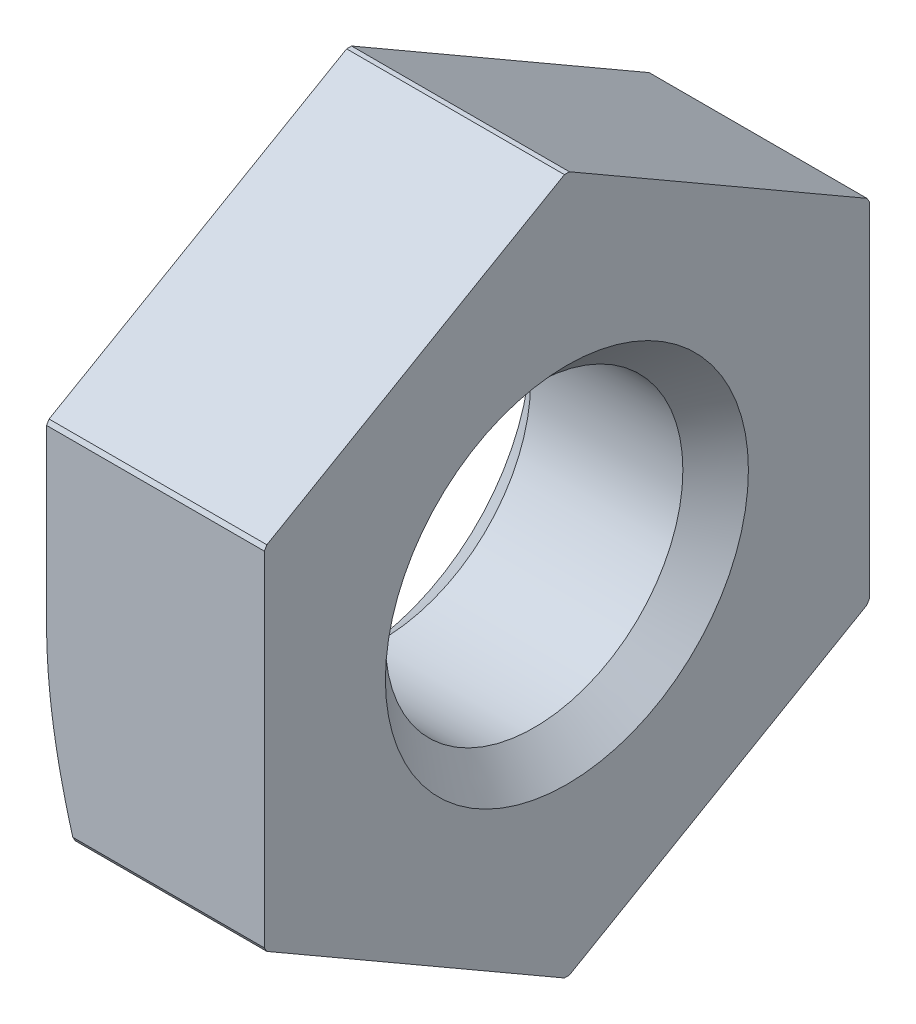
ISO-10303-21;
HEADER;
FILE_DESCRIPTION(('STEP AP214'),'2;1');
FILE_NAME('part.step','',(''),(''),'','','');
FILE_SCHEMA(('AUTOMOTIVE_DESIGN { 1 0 10303 214 1 1 1 1 }'));
ENDSEC;
DATA;
#1=APPLICATION_CONTEXT('core data for automotive mechanical design processes');
#2=APPLICATION_PROTOCOL_DEFINITION('international standard','automotive_design',2000,#1);
#3=PRODUCT_CONTEXT('',#1,'mechanical');
#4=PRODUCT('Part','Part','',(#3));
#5=PRODUCT_RELATED_PRODUCT_CATEGORY('part','',(#4));
#6=PRODUCT_DEFINITION_FORMATION('','',#4);
#7=PRODUCT_DEFINITION_CONTEXT('part definition',#1,'design');
#8=PRODUCT_DEFINITION('design','',#6,#7);
#9=PRODUCT_DEFINITION_SHAPE('','',#8);
#10=(LENGTH_UNIT() NAMED_UNIT(*) SI_UNIT(.MILLI.,.METRE.));
#11=(NAMED_UNIT(*) PLANE_ANGLE_UNIT() SI_UNIT($,.RADIAN.));
#12=(NAMED_UNIT(*) SI_UNIT($,.STERADIAN.) SOLID_ANGLE_UNIT());
#13=UNCERTAINTY_MEASURE_WITH_UNIT(LENGTH_MEASURE(1.E-05),#10,'distance_accuracy_value','');
#14=(GEOMETRIC_REPRESENTATION_CONTEXT(3) GLOBAL_UNCERTAINTY_ASSIGNED_CONTEXT((#13)) GLOBAL_UNIT_ASSIGNED_CONTEXT((#10,
#11,#12)) REPRESENTATION_CONTEXT('',''));
#15=CARTESIAN_POINT('',(0.,0.,0.));
#16=DIRECTION('',(0.,0.,1.));
#17=DIRECTION('',(1.,0.,0.));
#18=AXIS2_PLACEMENT_3D('',#15,#16,#17);
#19=CARTESIAN_POINT('',(-1.1,0.,0.));
#20=DIRECTION('',(1.,0.,0.));
#21=DIRECTION('',(0.,0.,-1.));
#22=AXIS2_PLACEMENT_3D('',#19,#20,#21);
#23=CYLINDRICAL_SURFACE('',#22,5.75);
#24=CARTESIAN_POINT('',(2.5,0.,0.));
#25=DIRECTION('',(1.,0.,0.));
#26=DIRECTION('',(0.,0.,-1.));
#27=AXIS2_PLACEMENT_3D('',#24,#25,#26);
#28=CIRCLE('',#27,5.75);
#29=CARTESIAN_POINT('',(2.5,2.91039993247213,4.95903944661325));
#30=VERTEX_POINT('',#29);
#31=CARTESIAN_POINT('',(2.5,2.83945417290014,5.));
#32=VERTEX_POINT('',#31);
#33=EDGE_CURVE('E181',#30,#32,#28,.T.);
#34=ORIENTED_EDGE('',*,*,#33,.F.);
#35=DIRECTION('',(1.,0.,0.));
#36=VECTOR('',#35,1.);
#37=CARTESIAN_POINT('',(-1.1,2.91039993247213,4.95903944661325));
#38=LINE('',#37,#36);
#39=CARTESIAN_POINT('',(-1.1,2.91039993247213,4.95903944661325));
#40=VERTEX_POINT('',#39);
#41=EDGE_CURVE('E151',#40,#30,#38,.T.);
#42=ORIENTED_EDGE('',*,*,#41,.F.);
#43=CARTESIAN_POINT('',(-1.1,0.,0.));
#44=DIRECTION('',(1.,0.,0.));
#45=DIRECTION('',(0.,0.,-1.));
#46=AXIS2_PLACEMENT_3D('',#43,#44,#45);
#47=CIRCLE('',#46,5.75);
#48=CARTESIAN_POINT('',(-1.1,2.83945417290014,5.));
#49=VERTEX_POINT('',#48);
#50=EDGE_CURVE('E147',#40,#49,#47,.T.);
#51=ORIENTED_EDGE('',*,*,#50,.T.);
#52=DIRECTION('',(1.,0.,0.));
#53=VECTOR('',#52,1.);
#54=CARTESIAN_POINT('',(-1.1,2.83945417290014,5.));
#55=LINE('',#54,#53);
#56=EDGE_CURVE('E131',#49,#32,#55,.T.);
#57=ORIENTED_EDGE('',*,*,#56,.T.);
#58=EDGE_LOOP('',(#34,#42,#51,#57));
#59=FACE_BOUND('',#58,.T.);
#60=ADVANCED_FACE('F32',(#59),#23,.T.);
#61=CARTESIAN_POINT('',(-1.1,5.74985410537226,0.040960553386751));
#62=DIRECTION('',(0.,0.866025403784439,0.5));
#63=DIRECTION('',(0.,-0.5,0.866025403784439));
#64=AXIS2_PLACEMENT_3D('',#61,#62,#63);
#65=PLANE('',#64);
#66=DIRECTION('',(0.,-0.5,0.866025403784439));
#67=VECTOR('',#66,1.);
#68=CARTESIAN_POINT('',(2.5,5.74985410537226,0.040960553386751));
#69=LINE('',#68,#67);
#70=CARTESIAN_POINT('',(2.5,5.74985410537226,0.0409605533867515));
#71=VERTEX_POINT('',#70);
#72=EDGE_CURVE('E152',#71,#30,#69,.T.);
#73=ORIENTED_EDGE('',*,*,#72,.F.);
#74=DIRECTION('',(1.,0.,0.));
#75=VECTOR('',#74,1.);
#76=CARTESIAN_POINT('',(-1.1,5.74985410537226,0.0409605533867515));
#77=LINE('',#76,#75);
#78=CARTESIAN_POINT('',(-1.1,5.74985410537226,0.0409605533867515));
#79=VERTEX_POINT('',#78);
#80=EDGE_CURVE('E212',#79,#71,#77,.T.);
#81=ORIENTED_EDGE('',*,*,#80,.F.);
#82=DIRECTION('',(0.,-0.5,0.866025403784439));
#83=VECTOR('',#82,1.);
#84=CARTESIAN_POINT('',(-1.1,5.74985410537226,0.040960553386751));
#85=LINE('',#84,#83);
#86=EDGE_CURVE('E142',#79,#40,#85,.T.);
#87=ORIENTED_EDGE('',*,*,#86,.T.);
#88=ORIENTED_EDGE('',*,*,#41,.T.);
#89=EDGE_LOOP('',(#73,#81,#87,#88));
#90=FACE_BOUND('',#89,.T.);
#91=ADVANCED_FACE('F265',(#90),#65,.T.);
#92=CARTESIAN_POINT('',(-1.1,0.,0.));
#93=DIRECTION('',(1.,0.,0.));
#94=DIRECTION('',(0.,0.,-1.));
#95=AXIS2_PLACEMENT_3D('',#92,#93,#94);
#96=CYLINDRICAL_SURFACE('',#95,5.75);
#97=CARTESIAN_POINT('',(2.5,0.,0.));
#98=DIRECTION('',(1.,0.,0.));
#99=DIRECTION('',(0.,0.,-1.));
#100=AXIS2_PLACEMENT_3D('',#97,#98,#99);
#101=CIRCLE('',#100,5.75);
#102=CARTESIAN_POINT('',(2.5,5.74985410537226,-0.0409605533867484));
#103=VERTEX_POINT('',#102);
#104=EDGE_CURVE('E155',#103,#71,#101,.T.);
#105=ORIENTED_EDGE('',*,*,#104,.F.);
#106=DIRECTION('',(1.,0.,0.));
#107=VECTOR('',#106,1.);
#108=CARTESIAN_POINT('',(-1.1,5.74985410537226,-0.0409605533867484));
#109=LINE('',#108,#107);
#110=CARTESIAN_POINT('',(-1.1,5.74985410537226,-0.0409605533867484));
#111=VERTEX_POINT('',#110);
#112=EDGE_CURVE('E214',#111,#103,#109,.T.);
#113=ORIENTED_EDGE('',*,*,#112,.F.);
#114=CARTESIAN_POINT('',(-1.1,0.,0.));
#115=DIRECTION('',(1.,0.,0.));
#116=DIRECTION('',(0.,0.,-1.));
#117=AXIS2_PLACEMENT_3D('',#114,#115,#116);
#118=CIRCLE('',#117,5.75);
#119=EDGE_CURVE('E177',#111,#79,#118,.T.);
#120=ORIENTED_EDGE('',*,*,#119,.T.);
#121=ORIENTED_EDGE('',*,*,#80,.T.);
#122=EDGE_LOOP('',(#105,#113,#120,#121));
#123=FACE_BOUND('',#122,.T.);
#124=ADVANCED_FACE('F296',(#123),#96,.T.);
#125=CARTESIAN_POINT('',(-1.1,2.91039993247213,-4.95903944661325));
#126=DIRECTION('',(0.,0.866025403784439,-0.5));
#127=DIRECTION('',(0.,0.5,0.866025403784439));
#128=AXIS2_PLACEMENT_3D('',#125,#126,#127);
#129=PLANE('',#128);
#130=DIRECTION('',(0.,0.5,0.866025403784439));
#131=VECTOR('',#130,1.);
#132=CARTESIAN_POINT('',(2.5,2.91039993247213,-4.95903944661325));
#133=LINE('',#132,#131);
#134=CARTESIAN_POINT('',(2.5,2.91039993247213,-4.95903944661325));
#135=VERTEX_POINT('',#134);
#136=EDGE_CURVE('E205',#135,#103,#133,.T.);
#137=ORIENTED_EDGE('',*,*,#136,.F.);
#138=DIRECTION('',(1.,0.,0.));
#139=VECTOR('',#138,1.);
#140=CARTESIAN_POINT('',(-1.1,2.91039993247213,-4.95903944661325));
#141=LINE('',#140,#139);
#142=CARTESIAN_POINT('',(-1.1,2.91039993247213,-4.95903944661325));
#143=VERTEX_POINT('',#142);
#144=EDGE_CURVE('E216',#143,#135,#141,.T.);
#145=ORIENTED_EDGE('',*,*,#144,.F.);
#146=DIRECTION('',(0.,0.5,0.866025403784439));
#147=VECTOR('',#146,1.);
#148=CARTESIAN_POINT('',(-1.1,2.91039993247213,-4.95903944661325));
#149=LINE('',#148,#147);
#150=EDGE_CURVE('E174',#143,#111,#149,.T.);
#151=ORIENTED_EDGE('',*,*,#150,.T.);
#152=ORIENTED_EDGE('',*,*,#112,.T.);
#153=EDGE_LOOP('',(#137,#145,#151,#152));
#154=FACE_BOUND('',#153,.T.);
#155=ADVANCED_FACE('F300',(#154),#129,.T.);
#156=CARTESIAN_POINT('',(-1.1,0.,0.));
#157=DIRECTION('',(1.,0.,0.));
#158=DIRECTION('',(0.,0.,-1.));
#159=AXIS2_PLACEMENT_3D('',#156,#157,#158);
#160=CYLINDRICAL_SURFACE('',#159,5.75);
#161=CARTESIAN_POINT('',(2.5,0.,0.));
#162=DIRECTION('',(1.,0.,0.));
#163=DIRECTION('',(0.,0.,-1.));
#164=AXIS2_PLACEMENT_3D('',#161,#162,#163);
#165=CIRCLE('',#164,5.75);
#166=CARTESIAN_POINT('',(2.5,2.83945417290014,-5.));
#167=VERTEX_POINT('',#166);
#168=EDGE_CURVE('E202',#167,#135,#165,.T.);
#169=ORIENTED_EDGE('',*,*,#168,.F.);
#170=DIRECTION('',(1.,0.,0.));
#171=VECTOR('',#170,1.);
#172=CARTESIAN_POINT('',(-1.1,2.83945417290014,-5.));
#173=LINE('',#172,#171);
#174=CARTESIAN_POINT('',(-1.1,2.83945417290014,-5.));
#175=VERTEX_POINT('',#174);
#176=EDGE_CURVE('E218',#175,#167,#173,.T.);
#177=ORIENTED_EDGE('',*,*,#176,.F.);
#178=CARTESIAN_POINT('',(-1.1,0.,0.));
#179=DIRECTION('',(1.,0.,0.));
#180=DIRECTION('',(0.,0.,-1.));
#181=AXIS2_PLACEMENT_3D('',#178,#179,#180);
#182=CIRCLE('',#181,5.75);
#183=EDGE_CURVE('E171',#175,#143,#182,.T.);
#184=ORIENTED_EDGE('',*,*,#183,.T.);
#185=ORIENTED_EDGE('',*,*,#144,.T.);
#186=EDGE_LOOP('',(#169,#177,#184,#185));
#187=FACE_BOUND('',#186,.T.);
#188=ADVANCED_FACE('F304',(#187),#160,.T.);
#189=CARTESIAN_POINT('',(-1.1,-2.83945417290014,-5.));
#190=DIRECTION('',(0.,0.,-1.));
#191=DIRECTION('',(-1.,0.,0.));
#192=AXIS2_PLACEMENT_3D('',#189,#190,#191);
#193=PLANE('',#192);
#194=DIRECTION('',(0.,1.,0.));
#195=VECTOR('',#194,1.);
#196=CARTESIAN_POINT('',(2.5,-2.83945417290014,-5.));
#197=LINE('',#196,#195);
#198=CARTESIAN_POINT('',(2.5,-2.83945417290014,-5.));
#199=VERTEX_POINT('',#198);
#200=EDGE_CURVE('E199',#199,#167,#197,.T.);
#201=ORIENTED_EDGE('',*,*,#200,.F.);
#202=DIRECTION('',(1.,0.,0.));
#203=VECTOR('',#202,1.);
#204=CARTESIAN_POINT('',(-1.1,-2.83945417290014,-5.));
#205=LINE('',#204,#203);
#206=CARTESIAN_POINT('',(-1.1,-2.83945417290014,-5.));
#207=VERTEX_POINT('',#206);
#208=EDGE_CURVE('E220',#207,#199,#205,.T.);
#209=ORIENTED_EDGE('',*,*,#208,.F.);
#210=DIRECTION('',(0.,1.,0.));
#211=VECTOR('',#210,1.);
#212=CARTESIAN_POINT('',(-1.1,-2.83945417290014,-5.));
#213=LINE('',#212,#211);
#214=EDGE_CURVE('E168',#207,#175,#213,.T.);
#215=ORIENTED_EDGE('',*,*,#214,.T.);
#216=ORIENTED_EDGE('',*,*,#176,.T.);
#217=EDGE_LOOP('',(#201,#209,#215,#216));
#218=FACE_BOUND('',#217,.T.);
#219=ADVANCED_FACE('F308',(#218),#193,.T.);
#220=CARTESIAN_POINT('',(-1.1,0.,0.));
#221=DIRECTION('',(1.,0.,0.));
#222=DIRECTION('',(0.,0.,-1.));
#223=AXIS2_PLACEMENT_3D('',#220,#221,#222);
#224=CYLINDRICAL_SURFACE('',#223,5.75);
#225=CARTESIAN_POINT('',(2.5,0.,0.));
#226=DIRECTION('',(1.,0.,0.));
#227=DIRECTION('',(0.,0.,-1.));
#228=AXIS2_PLACEMENT_3D('',#225,#226,#227);
#229=CIRCLE('',#228,5.75);
#230=CARTESIAN_POINT('',(2.5,-2.91039993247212,-4.95903944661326));
#231=VERTEX_POINT('',#230);
#232=EDGE_CURVE('E196',#231,#199,#229,.T.);
#233=ORIENTED_EDGE('',*,*,#232,.F.);
#234=DIRECTION('',(1.,0.,0.));
#235=VECTOR('',#234,1.);
#236=CARTESIAN_POINT('',(-1.1,-2.91039993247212,-4.95903944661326));
#237=LINE('',#236,#235);
#238=CARTESIAN_POINT('',(-1.1,-2.91039993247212,-4.95903944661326));
#239=VERTEX_POINT('',#238);
#240=EDGE_CURVE('E222',#239,#231,#237,.T.);
#241=ORIENTED_EDGE('',*,*,#240,.F.);
#242=CARTESIAN_POINT('',(-1.1,0.,0.));
#243=DIRECTION('',(1.,0.,0.));
#244=DIRECTION('',(0.,0.,-1.));
#245=AXIS2_PLACEMENT_3D('',#242,#243,#244);
#246=CIRCLE('',#245,5.75);
#247=EDGE_CURVE('E165',#239,#207,#246,.T.);
#248=ORIENTED_EDGE('',*,*,#247,.T.);
#249=ORIENTED_EDGE('',*,*,#208,.T.);
#250=EDGE_LOOP('',(#233,#241,#248,#249));
#251=FACE_BOUND('',#250,.T.);
#252=ADVANCED_FACE('F312',(#251),#224,.T.);
#253=CARTESIAN_POINT('',(-1.1,-5.74985410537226,-0.0409605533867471));
#254=DIRECTION('',(0.,-0.866025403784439,-0.5));
#255=DIRECTION('',(0.,0.5,-0.866025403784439));
#256=AXIS2_PLACEMENT_3D('',#253,#254,#255);
#257=PLANE('',#256);
#258=DIRECTION('',(0.,0.5,-0.866025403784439));
#259=VECTOR('',#258,1.);
#260=CARTESIAN_POINT('',(2.5,-5.74985410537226,-0.0409605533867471));
#261=LINE('',#260,#259);
#262=CARTESIAN_POINT('',(2.5,-5.74985410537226,-0.0409605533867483));
#263=VERTEX_POINT('',#262);
#264=EDGE_CURVE('E193',#263,#231,#261,.T.);
#265=ORIENTED_EDGE('',*,*,#264,.F.);
#266=DIRECTION('',(1.,0.,0.));
#267=VECTOR('',#266,1.);
#268=CARTESIAN_POINT('',(-1.1,-5.74985410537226,-0.0409605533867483));
#269=LINE('',#268,#267);
#270=CARTESIAN_POINT('',(-1.1,-5.74985410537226,-0.0409605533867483));
#271=VERTEX_POINT('',#270);
#272=EDGE_CURVE('E224',#271,#263,#269,.T.);
#273=ORIENTED_EDGE('',*,*,#272,.F.);
#274=DIRECTION('',(0.,0.5,-0.866025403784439));
#275=VECTOR('',#274,1.);
#276=CARTESIAN_POINT('',(-1.1,-5.74985410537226,-0.0409605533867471));
#277=LINE('',#276,#275);
#278=EDGE_CURVE('E162',#271,#239,#277,.T.);
#279=ORIENTED_EDGE('',*,*,#278,.T.);
#280=ORIENTED_EDGE('',*,*,#240,.T.);
#281=EDGE_LOOP('',(#265,#273,#279,#280));
#282=FACE_BOUND('',#281,.T.);
#283=ADVANCED_FACE('F315',(#282),#257,.T.);
#284=CARTESIAN_POINT('',(-1.1,0.,0.));
#285=DIRECTION('',(1.,0.,0.));
#286=DIRECTION('',(0.,0.,-1.));
#287=AXIS2_PLACEMENT_3D('',#284,#285,#286);
#288=CYLINDRICAL_SURFACE('',#287,5.75);
#289=CARTESIAN_POINT('',(2.5,0.,0.));
#290=DIRECTION('',(1.,0.,0.));
#291=DIRECTION('',(0.,0.,-1.));
#292=AXIS2_PLACEMENT_3D('',#289,#290,#291);
#293=CIRCLE('',#292,5.75);
#294=CARTESIAN_POINT('',(2.5,-5.74985410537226,0.0409605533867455));
#295=VERTEX_POINT('',#294);
#296=EDGE_CURVE('E190',#295,#263,#293,.T.);
#297=ORIENTED_EDGE('',*,*,#296,.F.);
#298=DIRECTION('',(1.,0.,0.));
#299=VECTOR('',#298,1.);
#300=CARTESIAN_POINT('',(-1.1,-5.74985410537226,0.0409605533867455));
#301=LINE('',#300,#299);
#302=CARTESIAN_POINT('',(-1.1,-5.74985410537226,0.0409605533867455));
#303=VERTEX_POINT('',#302);
#304=EDGE_CURVE('E226',#303,#295,#301,.T.);
#305=ORIENTED_EDGE('',*,*,#304,.F.);
#306=CARTESIAN_POINT('',(-1.1,0.,0.));
#307=DIRECTION('',(1.,0.,0.));
#308=DIRECTION('',(0.,0.,-1.));
#309=AXIS2_PLACEMENT_3D('',#306,#307,#308);
#310=CIRCLE('',#309,5.75);
#311=EDGE_CURVE('E159',#303,#271,#310,.T.);
#312=ORIENTED_EDGE('',*,*,#311,.T.);
#313=ORIENTED_EDGE('',*,*,#272,.T.);
#314=EDGE_LOOP('',(#297,#305,#312,#313));
#315=FACE_BOUND('',#314,.T.);
#316=ADVANCED_FACE('F256',(#315),#288,.T.);
#317=CARTESIAN_POINT('',(-1.1,-2.91039993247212,4.95903944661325));
#318=DIRECTION('',(0.,-0.866025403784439,0.5));
#319=DIRECTION('',(0.,-0.5,-0.866025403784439));
#320=AXIS2_PLACEMENT_3D('',#317,#318,#319);
#321=PLANE('',#320);
#322=DIRECTION('',(1.,0.,0.));
#323=VECTOR('',#322,1.);
#324=CARTESIAN_POINT('',(-1.1,-2.91039993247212,4.95903944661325));
#325=LINE('',#324,#323);
#326=CARTESIAN_POINT('',(-0.666987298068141,-2.91039993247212,4.95903944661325));
#327=VERTEX_POINT('',#326);
#328=CARTESIAN_POINT('',(2.5,-2.91039993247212,4.95903944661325));
#329=VERTEX_POINT('',#328);
#330=EDGE_CURVE('E228',#327,#329,#325,.T.);
#331=ORIENTED_EDGE('',*,*,#330,.F.);
#332=CARTESIAN_POINT('',(-0.666987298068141,-2.91039993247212,4.95903944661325));
#333=CARTESIAN_POINT('',(-0.732939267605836,-3.0260257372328,4.75876967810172));
#334=CARTESIAN_POINT('',(-0.793293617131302,-3.14256291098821,4.55692137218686));
#335=CARTESIAN_POINT('',(-0.899648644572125,-3.3766446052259,4.15147998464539));
#336=CARTESIAN_POINT('',(-0.945718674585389,-3.49418131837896,3.94790042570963));
#337=CARTESIAN_POINT('',(-1.0022437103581,-3.6715634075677,3.64066563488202));
#338=CARTESIAN_POINT('',(-1.01899522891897,-3.73090758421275,3.53787850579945));
#339=CARTESIAN_POINT('',(-1.04798386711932,-3.84987170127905,3.33182661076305));
#340=CARTESIAN_POINT('',(-1.06022109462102,-3.90949163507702,3.22856185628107));
#341=CARTESIAN_POINT('',(-1.07997267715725,-4.02922256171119,3.02118180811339));
#342=CARTESIAN_POINT('',(-1.08746357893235,-4.08933452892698,2.91706482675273));
#343=CARTESIAN_POINT('',(-1.09748725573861,-4.20967241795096,2.7086334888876));
#344=CARTESIAN_POINT('',(-1.10001911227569,-4.26989835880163,2.60431909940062));
#345=CARTESIAN_POINT('',(-1.09999999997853,-4.33012701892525,2.4999999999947));
#346=B_SPLINE_CURVE_WITH_KNOTS('',3,(#332,#333,#334,#335,#336,#337,#338,#339,#340,#341,#342,
#343,#344,#345),.UNSPECIFIED.,.F.,.F.,(4,2,2,2,2,2,4),(0.,0.721695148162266,1.43982943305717,
1.79934484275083,2.15885166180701,2.52012135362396,2.88145795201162),.UNSPECIFIED.);
#347=CARTESIAN_POINT('',(-1.1,-4.33012701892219,2.5));
#348=VERTEX_POINT('',#347);
#349=EDGE_CURVE('E60',#327,#348,#346,.T.);
#350=ORIENTED_EDGE('',*,*,#349,.T.);
#351=DIRECTION('',(0.,-0.5,-0.866025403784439));
#352=VECTOR('',#351,1.);
#353=CARTESIAN_POINT('',(-1.1,-2.91039993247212,4.95903944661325));
#354=LINE('',#353,#352);
#355=EDGE_CURVE('E149',#348,#303,#354,.T.);
#356=ORIENTED_EDGE('',*,*,#355,.T.);
#357=ORIENTED_EDGE('',*,*,#304,.T.);
#358=DIRECTION('',(0.,-0.5,-0.866025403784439));
#359=VECTOR('',#358,1.);
#360=CARTESIAN_POINT('',(2.5,-2.91039993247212,4.95903944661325));
#361=LINE('',#360,#359);
#362=EDGE_CURVE('E187',#329,#295,#361,.T.);
#363=ORIENTED_EDGE('',*,*,#362,.F.);
#364=EDGE_LOOP('',(#331,#350,#356,#357,#363));
#365=FACE_BOUND('',#364,.T.);
#366=ADVANCED_FACE('F250',(#365),#321,.T.);
#367=CARTESIAN_POINT('',(-1.1,0.,0.));
#368=DIRECTION('',(1.,0.,0.));
#369=DIRECTION('',(0.,0.,-1.));
#370=AXIS2_PLACEMENT_3D('',#367,#368,#369);
#371=CYLINDRICAL_SURFACE('',#370,5.75);
#372=DIRECTION('',(1.,0.,0.));
#373=VECTOR('',#372,1.);
#374=CARTESIAN_POINT('',(-1.1,-2.83945417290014,5.));
#375=LINE('',#374,#373);
#376=CARTESIAN_POINT('',(-0.666987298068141,-2.83945417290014,5.));
#377=VERTEX_POINT('',#376);
#378=CARTESIAN_POINT('',(2.5,-2.83945417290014,5.));
#379=VERTEX_POINT('',#378);
#380=EDGE_CURVE('E141',#377,#379,#375,.T.);
#381=ORIENTED_EDGE('',*,*,#380,.F.);
#382=CARTESIAN_POINT('',(-0.666987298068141,0.,0.));
#383=DIRECTION('',(1.,0.,0.));
#384=DIRECTION('',(0.,0.,-1.));
#385=AXIS2_PLACEMENT_3D('',#382,#383,#384);
#386=CIRCLE('',#385,5.75);
#387=EDGE_CURVE('E242',#377,#327,#386,.T.);
#388=ORIENTED_EDGE('',*,*,#387,.T.);
#389=ORIENTED_EDGE('',*,*,#330,.T.);
#390=CARTESIAN_POINT('',(2.5,0.,0.));
#391=DIRECTION('',(1.,0.,0.));
#392=DIRECTION('',(0.,0.,-1.));
#393=AXIS2_PLACEMENT_3D('',#390,#391,#392);
#394=CIRCLE('',#393,5.75);
#395=EDGE_CURVE('E184',#379,#329,#394,.T.);
#396=ORIENTED_EDGE('',*,*,#395,.F.);
#397=EDGE_LOOP('',(#381,#388,#389,#396));
#398=FACE_BOUND('',#397,.T.);
#399=ADVANCED_FACE('F255',(#398),#371,.T.);
#400=CARTESIAN_POINT('',(-1.1,2.83945417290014,5.));
#401=DIRECTION('',(0.,0.,1.));
#402=DIRECTION('',(1.,0.,0.));
#403=AXIS2_PLACEMENT_3D('',#400,#401,#402);
#404=PLANE('',#403);
#405=DIRECTION('',(0.,-1.,0.));
#406=VECTOR('',#405,1.);
#407=CARTESIAN_POINT('',(-1.1,2.83945417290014,5.));
#408=LINE('',#407,#406);
#409=CARTESIAN_POINT('',(-1.1,0.,5.));
#410=VERTEX_POINT('',#409);
#411=EDGE_CURVE('E133',#49,#410,#408,.T.);
#412=ORIENTED_EDGE('',*,*,#411,.T.);
#413=CARTESIAN_POINT('',(-1.1,0.,4.9999999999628));
#414=CARTESIAN_POINT('',(-1.10001911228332,-0.12045732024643,4.99999999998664));
#415=CARTESIAN_POINT('',(-1.09748725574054,-0.240909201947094,4.99999999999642));
#416=CARTESIAN_POINT('',(-1.08746357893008,-0.48158497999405,5.00000000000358));
#417=CARTESIAN_POINT('',(-1.07997267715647,-0.601808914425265,5.00000000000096));
#418=CARTESIAN_POINT('',(-1.06022109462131,-0.841270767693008,4.99999999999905));
#419=CARTESIAN_POINT('',(-1.04798386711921,-0.960510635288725,4.99999999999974));
#420=CARTESIAN_POINT('',(-1.01899522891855,-1.19843886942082,5.00000000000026));
#421=CARTESIAN_POINT('',(-1.00224371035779,-1.31712722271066,5.0000000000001));
#422=CARTESIAN_POINT('',(-0.945718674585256,-1.67189140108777,4.99999999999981));
#423=CARTESIAN_POINT('',(-0.899648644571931,-1.90696482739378,4.9999999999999));
#424=CARTESIAN_POINT('',(-0.793293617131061,-2.37512821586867,5.0000000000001));
#425=CARTESIAN_POINT('',(-0.732939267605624,-2.60820256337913,5.00000000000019));
#426=CARTESIAN_POINT('',(-0.66698729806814,-2.83945417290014,5.));
#427=B_SPLINE_CURVE_WITH_KNOTS('',3,(#413,#414,#415,#416,#417,#418,#419,#420,#421,#422,#423,
#424,#425,#426),.UNSPECIFIED.,.F.,.F.,(4,2,2,2,2,2,4),(0.,0.36133659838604,0.722606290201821,
1.08211310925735,1.44162851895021,2.15976280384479,2.88145795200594),.UNSPECIFIED.);
#428=EDGE_CURVE('E11',#410,#377,#427,.T.);
#429=ORIENTED_EDGE('',*,*,#428,.T.);
#430=ORIENTED_EDGE('',*,*,#380,.T.);
#431=DIRECTION('',(0.,-1.,0.));
#432=VECTOR('',#431,1.);
#433=CARTESIAN_POINT('',(2.5,2.83945417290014,5.));
#434=LINE('',#433,#432);
#435=EDGE_CURVE('E136',#32,#379,#434,.T.);
#436=ORIENTED_EDGE('',*,*,#435,.F.);
#437=ORIENTED_EDGE('',*,*,#56,.F.);
#438=EDGE_LOOP('',(#412,#429,#430,#436,#437));
#439=FACE_BOUND('',#438,.T.);
#440=ADVANCED_FACE('F132',(#439),#404,.T.);
#441=CARTESIAN_POINT('',(-1.1,0.,0.));
#442=DIRECTION('',(1.,0.,0.));
#443=DIRECTION('',(0.,0.,-1.));
#444=AXIS2_PLACEMENT_3D('',#441,#442,#443);
#445=PLANE('',#444);
#446=CARTESIAN_POINT('',(-1.1,0.,0.));
#447=DIRECTION('',(1.,0.,0.));
#448=DIRECTION('',(0.,0.,-1.));
#449=AXIS2_PLACEMENT_3D('',#446,#447,#448);
#450=CIRCLE('',#449,2.99999999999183);
#451=CARTESIAN_POINT('',(-1.1,0.,-2.99999999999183));
#452=VERTEX_POINT('',#451);
#453=EDGE_CURVE('E211',#452,#452,#450,.T.);
#454=ORIENTED_EDGE('',*,*,#453,.T.);
#455=EDGE_LOOP('',(#454));
#456=FACE_BOUND('',#455,.T.);
#457=ORIENTED_EDGE('',*,*,#355,.F.);
#458=CARTESIAN_POINT('',(-1.1,0.,0.));
#459=DIRECTION('',(1.,0.,0.));
#460=DIRECTION('',(0.,0.,-1.));
#461=AXIS2_PLACEMENT_3D('',#458,#459,#460);
#462=CIRCLE('',#461,4.9999999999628);
#463=EDGE_CURVE('E46',#348,#410,#462,.F.);
#464=ORIENTED_EDGE('',*,*,#463,.T.);
#465=ORIENTED_EDGE('',*,*,#411,.F.);
#466=ORIENTED_EDGE('',*,*,#50,.F.);
#467=ORIENTED_EDGE('',*,*,#86,.F.);
#468=ORIENTED_EDGE('',*,*,#119,.F.);
#469=ORIENTED_EDGE('',*,*,#150,.F.);
#470=ORIENTED_EDGE('',*,*,#183,.F.);
#471=ORIENTED_EDGE('',*,*,#214,.F.);
#472=ORIENTED_EDGE('',*,*,#247,.F.);
#473=ORIENTED_EDGE('',*,*,#278,.F.);
#474=ORIENTED_EDGE('',*,*,#311,.F.);
#475=EDGE_LOOP('',(#457,#464,#465,#466,#467,#468,#469,#470,#471,#472,#473,#474));
#476=FACE_BOUND('',#475,.T.);
#477=ADVANCED_FACE('F145',(#456,#476),#445,.F.);
#478=CARTESIAN_POINT('',(2.5,0.,0.));
#479=DIRECTION('',(1.,0.,0.));
#480=DIRECTION('',(0.,0.,-1.));
#481=AXIS2_PLACEMENT_3D('',#478,#479,#480);
#482=PLANE('',#481);
#483=CARTESIAN_POINT('',(2.5,0.,0.));
#484=DIRECTION('',(1.,0.,0.));
#485=DIRECTION('',(0.,0.,-1.));
#486=AXIS2_PLACEMENT_3D('',#483,#484,#485);
#487=CIRCLE('',#486,2.99999999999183);
#488=CARTESIAN_POINT('',(2.5,0.,-2.99999999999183));
#489=VERTEX_POINT('',#488);
#490=EDGE_CURVE('E239',#489,#489,#487,.F.);
#491=ORIENTED_EDGE('',*,*,#490,.T.);
#492=EDGE_LOOP('',(#491));
#493=FACE_BOUND('',#492,.T.);
#494=ORIENTED_EDGE('',*,*,#33,.T.);
#495=ORIENTED_EDGE('',*,*,#435,.T.);
#496=ORIENTED_EDGE('',*,*,#395,.T.);
#497=ORIENTED_EDGE('',*,*,#362,.T.);
#498=ORIENTED_EDGE('',*,*,#296,.T.);
#499=ORIENTED_EDGE('',*,*,#264,.T.);
#500=ORIENTED_EDGE('',*,*,#232,.T.);
#501=ORIENTED_EDGE('',*,*,#200,.T.);
#502=ORIENTED_EDGE('',*,*,#168,.T.);
#503=ORIENTED_EDGE('',*,*,#136,.T.);
#504=ORIENTED_EDGE('',*,*,#104,.T.);
#505=ORIENTED_EDGE('',*,*,#72,.T.);
#506=EDGE_LOOP('',(#494,#495,#496,#497,#498,#499,#500,#501,#502,#503,#504,#505));
#507=FACE_BOUND('',#506,.T.);
#508=ADVANCED_FACE('F282',(#493,#507),#482,.T.);
#509=CARTESIAN_POINT('',(2.5,0.,0.));
#510=DIRECTION('',(1.,0.,0.));
#511=DIRECTION('',(0.,0.,-1.));
#512=AXIS2_PLACEMENT_3D('',#509,#510,#511);
#513=CYLINDRICAL_SURFACE('',#512,2.45850000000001);
#514=CARTESIAN_POINT('',(-0.558500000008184,0.,0.));
#515=DIRECTION('',(1.,0.,0.));
#516=DIRECTION('',(0.,0.,-1.));
#517=AXIS2_PLACEMENT_3D('',#514,#515,#516);
#518=CIRCLE('',#517,2.45850000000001);
#519=CARTESIAN_POINT('',(-0.558500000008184,0.,-2.45850000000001));
#520=VERTEX_POINT('',#519);
#521=EDGE_CURVE('E236',#520,#520,#518,.F.);
#522=ORIENTED_EDGE('',*,*,#521,.T.);
#523=EDGE_LOOP('',(#522));
#524=FACE_BOUND('',#523,.T.);
#525=CARTESIAN_POINT('',(1.95850000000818,0.,0.));
#526=DIRECTION('',(1.,0.,0.));
#527=DIRECTION('',(0.,0.,-1.));
#528=AXIS2_PLACEMENT_3D('',#525,#526,#527);
#529=CIRCLE('',#528,2.45850000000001);
#530=CARTESIAN_POINT('',(1.95850000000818,0.,-2.45850000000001));
#531=VERTEX_POINT('',#530);
#532=EDGE_CURVE('E233',#531,#531,#529,.T.);
#533=ORIENTED_EDGE('',*,*,#532,.T.);
#534=EDGE_LOOP('',(#533));
#535=FACE_BOUND('',#534,.T.);
#536=ADVANCED_FACE('F269',(#524,#535),#513,.F.);
#537=CARTESIAN_POINT('',(-1.1,0.,0.));
#538=DIRECTION('',(-1.,0.,0.));
#539=DIRECTION('',(0.,0.,1.));
#540=AXIS2_PLACEMENT_3D('',#537,#538,#539);
#541=CONICAL_SURFACE('',#540,2.99999999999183,0.785398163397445);
#542=ORIENTED_EDGE('',*,*,#521,.F.);
#543=EDGE_LOOP('',(#542));
#544=FACE_BOUND('',#543,.T.);
#545=ORIENTED_EDGE('',*,*,#453,.F.);
#546=EDGE_LOOP('',(#545));
#547=FACE_BOUND('',#546,.T.);
#548=ADVANCED_FACE('F266',(#544,#547),#541,.F.);
#549=CARTESIAN_POINT('',(1.95850000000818,0.,0.));
#550=DIRECTION('',(1.,0.,0.));
#551=DIRECTION('',(0.,0.,-1.));
#552=AXIS2_PLACEMENT_3D('',#549,#550,#551);
#553=CONICAL_SURFACE('',#552,2.45850000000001,0.785398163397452);
#554=ORIENTED_EDGE('',*,*,#490,.F.);
#555=EDGE_LOOP('',(#554));
#556=FACE_BOUND('',#555,.T.);
#557=ORIENTED_EDGE('',*,*,#532,.F.);
#558=EDGE_LOOP('',(#557));
#559=FACE_BOUND('',#558,.T.);
#560=ADVANCED_FACE('F268',(#556,#559),#553,.F.);
#561=CARTESIAN_POINT('',(-0.666987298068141,0.,0.));
#562=DIRECTION('',(1.,0.,0.));
#563=DIRECTION('',(0.,0.,-1.));
#564=AXIS2_PLACEMENT_3D('',#561,#562,#563);
#565=CONICAL_SURFACE('',#564,5.75,1.04719755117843);
#566=ORIENTED_EDGE('',*,*,#428,.F.);
#567=ORIENTED_EDGE('',*,*,#463,.F.);
#568=ORIENTED_EDGE('',*,*,#349,.F.);
#569=ORIENTED_EDGE('',*,*,#387,.F.);
#570=EDGE_LOOP('',(#566,#567,#568,#569));
#571=FACE_BOUND('',#570,.T.);
#572=ADVANCED_FACE('F34',(#571),#565,.T.);
#573=CLOSED_SHELL('',(#60,#91,#124,#155,#188,#219,#252,#283,#316,#366,#399,#440,#477,#508,#536,
#548,#560,#572));
#574=MANIFOLD_SOLID_BREP('B2',#573);
#575=ADVANCED_BREP_SHAPE_REPRESENTATION('',(#18,#574),#14);
#576=SHAPE_DEFINITION_REPRESENTATION(#9,#575);
ENDSEC;
END-ISO-10303-21;
